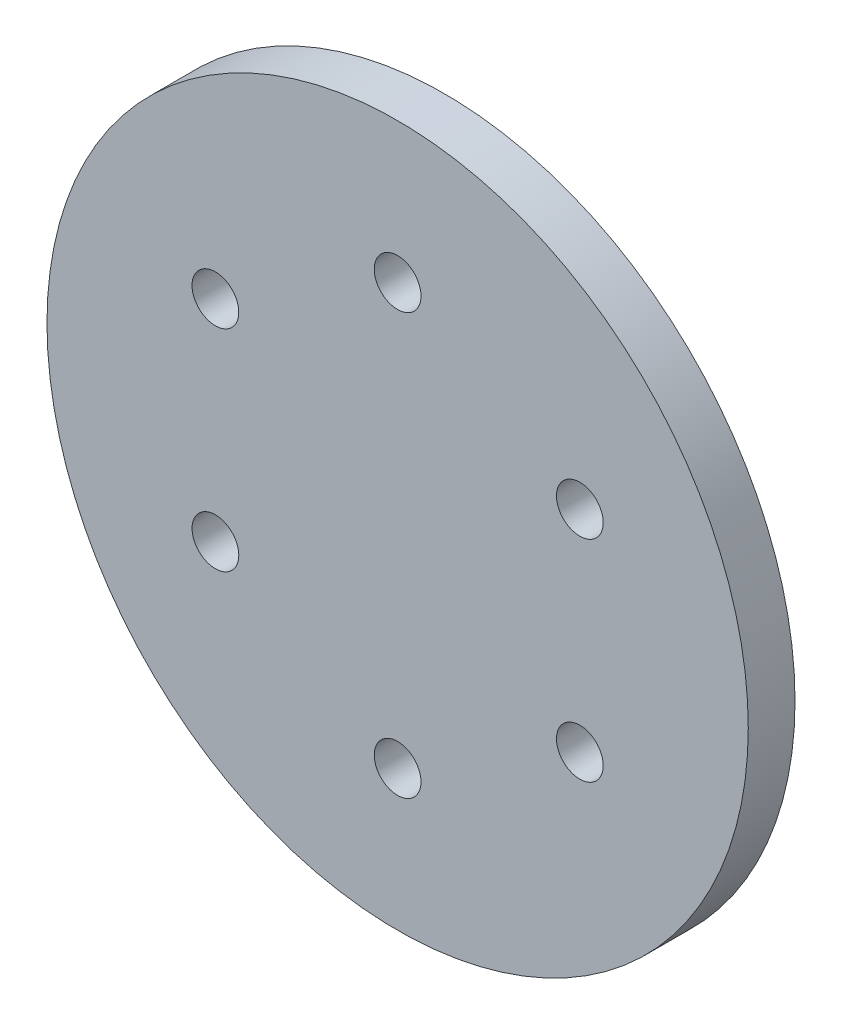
ISO-10303-21;
HEADER;
FILE_DESCRIPTION(('STEP AP214'),'2;1');
FILE_NAME('part.step','',(''),(''),'','','');
FILE_SCHEMA(('AUTOMOTIVE_DESIGN { 1 0 10303 214 1 1 1 1 }'));
ENDSEC;
DATA;
#1=APPLICATION_CONTEXT('core data for automotive mechanical design processes');
#2=APPLICATION_PROTOCOL_DEFINITION('international standard','automotive_design',2000,#1);
#3=PRODUCT_CONTEXT('',#1,'mechanical');
#4=PRODUCT('Part','Part','',(#3));
#5=PRODUCT_RELATED_PRODUCT_CATEGORY('part','',(#4));
#6=PRODUCT_DEFINITION_FORMATION('','',#4);
#7=PRODUCT_DEFINITION_CONTEXT('part definition',#1,'design');
#8=PRODUCT_DEFINITION('design','',#6,#7);
#9=PRODUCT_DEFINITION_SHAPE('','',#8);
#10=(LENGTH_UNIT() NAMED_UNIT(*) SI_UNIT(.MILLI.,.METRE.));
#11=(NAMED_UNIT(*) PLANE_ANGLE_UNIT() SI_UNIT($,.RADIAN.));
#12=(NAMED_UNIT(*) SI_UNIT($,.STERADIAN.) SOLID_ANGLE_UNIT());
#13=UNCERTAINTY_MEASURE_WITH_UNIT(LENGTH_MEASURE(1.E-05),#10,'distance_accuracy_value','');
#14=(GEOMETRIC_REPRESENTATION_CONTEXT(3) GLOBAL_UNCERTAINTY_ASSIGNED_CONTEXT((#13)) GLOBAL_UNIT_ASSIGNED_CONTEXT((#10,
#11,#12)) REPRESENTATION_CONTEXT('',''));
#15=CARTESIAN_POINT('',(0.,0.,0.));
#16=DIRECTION('',(0.,0.,1.));
#17=DIRECTION('',(1.,0.,0.));
#18=AXIS2_PLACEMENT_3D('',#15,#16,#17);
#19=CARTESIAN_POINT('',(0.,0.,10.));
#20=DIRECTION('',(0.,0.,-1.));
#21=DIRECTION('',(-1.,0.,0.));
#22=AXIS2_PLACEMENT_3D('',#19,#20,#21);
#23=CYLINDRICAL_SURFACE('',#22,75.);
#24=CARTESIAN_POINT('',(0.,0.,10.));
#25=DIRECTION('',(0.,0.,1.));
#26=DIRECTION('',(1.,0.,0.));
#27=AXIS2_PLACEMENT_3D('',#24,#25,#26);
#28=CIRCLE('',#27,75.);
#29=CARTESIAN_POINT('',(75.,0.,10.));
#30=VERTEX_POINT('',#29);
#31=EDGE_CURVE('E10',#30,#30,#28,.T.);
#32=ORIENTED_EDGE('',*,*,#31,.F.);
#33=EDGE_LOOP('',(#32));
#34=FACE_BOUND('',#33,.T.);
#35=CARTESIAN_POINT('',(0.,0.,0.));
#36=DIRECTION('',(0.,0.,1.));
#37=DIRECTION('',(1.,0.,0.));
#38=AXIS2_PLACEMENT_3D('',#35,#36,#37);
#39=CIRCLE('',#38,75.);
#40=CARTESIAN_POINT('',(75.,0.,0.));
#41=VERTEX_POINT('',#40);
#42=EDGE_CURVE('E34',#41,#41,#39,.T.);
#43=ORIENTED_EDGE('',*,*,#42,.T.);
#44=EDGE_LOOP('',(#43));
#45=FACE_BOUND('',#44,.T.);
#46=ADVANCED_FACE('F31',(#34,#45),#23,.T.);
#47=CARTESIAN_POINT('',(0.,0.,10.));
#48=DIRECTION('',(0.,0.,1.));
#49=DIRECTION('',(1.,0.,0.));
#50=AXIS2_PLACEMENT_3D('',#47,#48,#49);
#51=PLANE('',#50);
#52=CARTESIAN_POINT('',(38.9711431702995,22.5000000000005,10.));
#53=DIRECTION('',(0.,0.,1.));
#54=DIRECTION('',(0.50000000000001,-0.866025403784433,0.));
#55=AXIS2_PLACEMENT_3D('',#52,#53,#54);
#56=CIRCLE('',#55,5.);
#57=CARTESIAN_POINT('',(41.4711431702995,18.1698729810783,10.));
#58=VERTEX_POINT('',#57);
#59=EDGE_CURVE('E73',#58,#58,#56,.T.);
#60=ORIENTED_EDGE('',*,*,#59,.F.);
#61=EDGE_LOOP('',(#60));
#62=FACE_BOUND('',#61,.T.);
#63=CARTESIAN_POINT('',(38.9711431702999,-22.4999999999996,10.));
#64=DIRECTION('',(0.,0.,1.));
#65=DIRECTION('',(-0.499999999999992,-0.866025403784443,0.));
#66=AXIS2_PLACEMENT_3D('',#63,#64,#65);
#67=CIRCLE('',#66,5.);
#68=CARTESIAN_POINT('',(36.4711431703,-26.8301270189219,10.));
#69=VERTEX_POINT('',#68);
#70=EDGE_CURVE('E67',#69,#69,#67,.T.);
#71=ORIENTED_EDGE('',*,*,#70,.F.);
#72=EDGE_LOOP('',(#71));
#73=FACE_BOUND('',#72,.T.);
#74=CARTESIAN_POINT('',(0.,-45.,10.));
#75=DIRECTION('',(0.,0.,1.));
#76=DIRECTION('',(-1.,0.,0.));
#77=AXIS2_PLACEMENT_3D('',#74,#75,#76);
#78=CIRCLE('',#77,5.);
#79=CARTESIAN_POINT('',(-5.,-45.,10.));
#80=VERTEX_POINT('',#79);
#81=EDGE_CURVE('E61',#80,#80,#78,.T.);
#82=ORIENTED_EDGE('',*,*,#81,.F.);
#83=EDGE_LOOP('',(#82));
#84=FACE_BOUND('',#83,.T.);
#85=CARTESIAN_POINT('',(-38.9711431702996,-22.5000000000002,10.));
#86=DIRECTION('',(0.,0.,1.));
#87=DIRECTION('',(-0.500000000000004,0.866025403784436,0.));
#88=AXIS2_PLACEMENT_3D('',#85,#86,#87);
#89=CIRCLE('',#88,5.);
#90=CARTESIAN_POINT('',(-41.4711431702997,-18.169872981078,10.));
#91=VERTEX_POINT('',#90);
#92=EDGE_CURVE('E55',#91,#91,#89,.T.);
#93=ORIENTED_EDGE('',*,*,#92,.F.);
#94=EDGE_LOOP('',(#93));
#95=FACE_BOUND('',#94,.T.);
#96=CARTESIAN_POINT('',(-38.9711431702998,22.4999999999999,10.));
#97=DIRECTION('',(0.,0.,1.));
#98=DIRECTION('',(0.499999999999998,0.86602540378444,0.));
#99=AXIS2_PLACEMENT_3D('',#96,#97,#98);
#100=CIRCLE('',#99,5.);
#101=CARTESIAN_POINT('',(-36.4711431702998,26.8301270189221,10.));
#102=VERTEX_POINT('',#101);
#103=EDGE_CURVE('E49',#102,#102,#100,.T.);
#104=ORIENTED_EDGE('',*,*,#103,.F.);
#105=EDGE_LOOP('',(#104));
#106=FACE_BOUND('',#105,.T.);
#107=CARTESIAN_POINT('',(0.,45.,10.));
#108=DIRECTION('',(0.,0.,1.));
#109=DIRECTION('',(1.,0.,0.));
#110=AXIS2_PLACEMENT_3D('',#107,#108,#109);
#111=CIRCLE('',#110,5.);
#112=CARTESIAN_POINT('',(5.,45.,10.));
#113=VERTEX_POINT('',#112);
#114=EDGE_CURVE('E43',#113,#113,#111,.T.);
#115=ORIENTED_EDGE('',*,*,#114,.F.);
#116=EDGE_LOOP('',(#115));
#117=FACE_BOUND('',#116,.T.);
#118=ORIENTED_EDGE('',*,*,#31,.T.);
#119=EDGE_LOOP('',(#118));
#120=FACE_BOUND('',#119,.T.);
#121=ADVANCED_FACE('F89',(#62,#73,#84,#95,#106,#117,#120),#51,.T.);
#122=CARTESIAN_POINT('',(0.,0.,0.));
#123=DIRECTION('',(0.,0.,1.));
#124=DIRECTION('',(1.,0.,0.));
#125=AXIS2_PLACEMENT_3D('',#122,#123,#124);
#126=PLANE('',#125);
#127=CARTESIAN_POINT('',(38.9711431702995,22.5000000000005,0.));
#128=DIRECTION('',(0.,0.,1.));
#129=DIRECTION('',(0.50000000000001,-0.866025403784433,0.));
#130=AXIS2_PLACEMENT_3D('',#127,#128,#129);
#131=CIRCLE('',#130,5.);
#132=CARTESIAN_POINT('',(41.4711431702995,18.1698729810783,0.));
#133=VERTEX_POINT('',#132);
#134=EDGE_CURVE('E70',#133,#133,#131,.T.);
#135=ORIENTED_EDGE('',*,*,#134,.T.);
#136=EDGE_LOOP('',(#135));
#137=FACE_BOUND('',#136,.T.);
#138=CARTESIAN_POINT('',(38.9711431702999,-22.4999999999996,0.));
#139=DIRECTION('',(0.,0.,1.));
#140=DIRECTION('',(-0.499999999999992,-0.866025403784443,0.));
#141=AXIS2_PLACEMENT_3D('',#138,#139,#140);
#142=CIRCLE('',#141,5.);
#143=CARTESIAN_POINT('',(36.4711431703,-26.8301270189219,0.));
#144=VERTEX_POINT('',#143);
#145=EDGE_CURVE('E64',#144,#144,#142,.T.);
#146=ORIENTED_EDGE('',*,*,#145,.T.);
#147=EDGE_LOOP('',(#146));
#148=FACE_BOUND('',#147,.T.);
#149=CARTESIAN_POINT('',(0.,-45.,0.));
#150=DIRECTION('',(0.,0.,1.));
#151=DIRECTION('',(-1.,0.,0.));
#152=AXIS2_PLACEMENT_3D('',#149,#150,#151);
#153=CIRCLE('',#152,5.);
#154=CARTESIAN_POINT('',(-5.,-45.,0.));
#155=VERTEX_POINT('',#154);
#156=EDGE_CURVE('E58',#155,#155,#153,.T.);
#157=ORIENTED_EDGE('',*,*,#156,.T.);
#158=EDGE_LOOP('',(#157));
#159=FACE_BOUND('',#158,.T.);
#160=CARTESIAN_POINT('',(-38.9711431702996,-22.5000000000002,0.));
#161=DIRECTION('',(0.,0.,1.));
#162=DIRECTION('',(-0.500000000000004,0.866025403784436,0.));
#163=AXIS2_PLACEMENT_3D('',#160,#161,#162);
#164=CIRCLE('',#163,5.);
#165=CARTESIAN_POINT('',(-41.4711431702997,-18.169872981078,0.));
#166=VERTEX_POINT('',#165);
#167=EDGE_CURVE('E52',#166,#166,#164,.T.);
#168=ORIENTED_EDGE('',*,*,#167,.T.);
#169=EDGE_LOOP('',(#168));
#170=FACE_BOUND('',#169,.T.);
#171=CARTESIAN_POINT('',(-38.9711431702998,22.4999999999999,0.));
#172=DIRECTION('',(0.,0.,1.));
#173=DIRECTION('',(0.499999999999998,0.86602540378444,0.));
#174=AXIS2_PLACEMENT_3D('',#171,#172,#173);
#175=CIRCLE('',#174,5.);
#176=CARTESIAN_POINT('',(-36.4711431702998,26.8301270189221,0.));
#177=VERTEX_POINT('',#176);
#178=EDGE_CURVE('E46',#177,#177,#175,.T.);
#179=ORIENTED_EDGE('',*,*,#178,.T.);
#180=EDGE_LOOP('',(#179));
#181=FACE_BOUND('',#180,.T.);
#182=CARTESIAN_POINT('',(0.,45.,0.));
#183=DIRECTION('',(0.,0.,1.));
#184=DIRECTION('',(1.,0.,0.));
#185=AXIS2_PLACEMENT_3D('',#182,#183,#184);
#186=CIRCLE('',#185,5.);
#187=CARTESIAN_POINT('',(5.,45.,0.));
#188=VERTEX_POINT('',#187);
#189=EDGE_CURVE('E41',#188,#188,#186,.T.);
#190=ORIENTED_EDGE('',*,*,#189,.T.);
#191=EDGE_LOOP('',(#190));
#192=FACE_BOUND('',#191,.T.);
#193=ORIENTED_EDGE('',*,*,#42,.F.);
#194=EDGE_LOOP('',(#193));
#195=FACE_BOUND('',#194,.T.);
#196=ADVANCED_FACE('F79',(#137,#148,#159,#170,#181,#192,#195),#126,.F.);
#197=CARTESIAN_POINT('',(0.,45.,0.));
#198=DIRECTION('',(0.,0.,1.));
#199=DIRECTION('',(1.,0.,0.));
#200=AXIS2_PLACEMENT_3D('',#197,#198,#199);
#201=CYLINDRICAL_SURFACE('',#200,5.);
#202=ORIENTED_EDGE('',*,*,#189,.F.);
#203=EDGE_LOOP('',(#202));
#204=FACE_BOUND('',#203,.T.);
#205=ORIENTED_EDGE('',*,*,#114,.T.);
#206=EDGE_LOOP('',(#205));
#207=FACE_BOUND('',#206,.T.);
#208=ADVANCED_FACE('F103',(#204,#207),#201,.F.);
#209=CARTESIAN_POINT('',(-38.9711431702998,22.4999999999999,0.));
#210=DIRECTION('',(0.,0.,1.));
#211=DIRECTION('',(1.,0.,0.));
#212=AXIS2_PLACEMENT_3D('',#209,#210,#211);
#213=CYLINDRICAL_SURFACE('',#212,5.);
#214=ORIENTED_EDGE('',*,*,#178,.F.);
#215=EDGE_LOOP('',(#214));
#216=FACE_BOUND('',#215,.T.);
#217=ORIENTED_EDGE('',*,*,#103,.T.);
#218=EDGE_LOOP('',(#217));
#219=FACE_BOUND('',#218,.T.);
#220=ADVANCED_FACE('F105',(#216,#219),#213,.F.);
#221=CARTESIAN_POINT('',(-38.9711431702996,-22.5000000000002,0.));
#222=DIRECTION('',(0.,0.,1.));
#223=DIRECTION('',(1.,0.,0.));
#224=AXIS2_PLACEMENT_3D('',#221,#222,#223);
#225=CYLINDRICAL_SURFACE('',#224,5.);
#226=ORIENTED_EDGE('',*,*,#167,.F.);
#227=EDGE_LOOP('',(#226));
#228=FACE_BOUND('',#227,.T.);
#229=ORIENTED_EDGE('',*,*,#92,.T.);
#230=EDGE_LOOP('',(#229));
#231=FACE_BOUND('',#230,.T.);
#232=ADVANCED_FACE('F112',(#228,#231),#225,.F.);
#233=CARTESIAN_POINT('',(0.,-45.,0.));
#234=DIRECTION('',(0.,0.,1.));
#235=DIRECTION('',(1.,0.,0.));
#236=AXIS2_PLACEMENT_3D('',#233,#234,#235);
#237=CYLINDRICAL_SURFACE('',#236,5.);
#238=ORIENTED_EDGE('',*,*,#156,.F.);
#239=EDGE_LOOP('',(#238));
#240=FACE_BOUND('',#239,.T.);
#241=ORIENTED_EDGE('',*,*,#81,.T.);
#242=EDGE_LOOP('',(#241));
#243=FACE_BOUND('',#242,.T.);
#244=ADVANCED_FACE('F147',(#240,#243),#237,.F.);
#245=CARTESIAN_POINT('',(38.9711431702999,-22.4999999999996,0.));
#246=DIRECTION('',(0.,0.,1.));
#247=DIRECTION('',(1.,0.,0.));
#248=AXIS2_PLACEMENT_3D('',#245,#246,#247);
#249=CYLINDRICAL_SURFACE('',#248,5.);
#250=ORIENTED_EDGE('',*,*,#145,.F.);
#251=EDGE_LOOP('',(#250));
#252=FACE_BOUND('',#251,.T.);
#253=ORIENTED_EDGE('',*,*,#70,.T.);
#254=EDGE_LOOP('',(#253));
#255=FACE_BOUND('',#254,.T.);
#256=ADVANCED_FACE('F85',(#252,#255),#249,.F.);
#257=CARTESIAN_POINT('',(38.9711431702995,22.5000000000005,0.));
#258=DIRECTION('',(0.,0.,1.));
#259=DIRECTION('',(1.,0.,0.));
#260=AXIS2_PLACEMENT_3D('',#257,#258,#259);
#261=CYLINDRICAL_SURFACE('',#260,5.);
#262=ORIENTED_EDGE('',*,*,#134,.F.);
#263=EDGE_LOOP('',(#262));
#264=FACE_BOUND('',#263,.T.);
#265=ORIENTED_EDGE('',*,*,#59,.T.);
#266=EDGE_LOOP('',(#265));
#267=FACE_BOUND('',#266,.T.);
#268=ADVANCED_FACE('F82',(#264,#267),#261,.F.);
#269=CLOSED_SHELL('',(#46,#121,#196,#208,#220,#232,#244,#256,#268));
#270=MANIFOLD_SOLID_BREP('B2',#269);
#271=ADVANCED_BREP_SHAPE_REPRESENTATION('',(#18,#270),#14);
#272=SHAPE_DEFINITION_REPRESENTATION(#9,#271);
ENDSEC;
END-ISO-10303-21;
